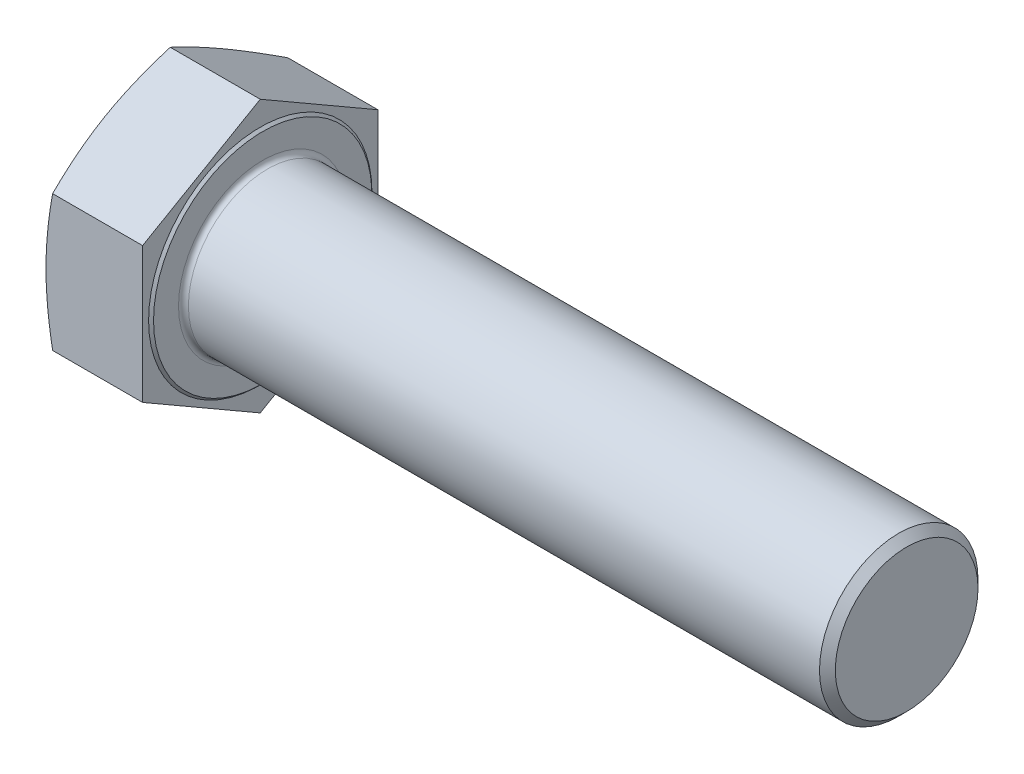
from build123d import *

# Parameters (mm, degrees)
BASEHEAD_DEPTH = 40
SKETCH5_R      = 32
BASEBODY_DEPTH = 260
CHAMFER1_SIZE  = 3.2
HEADFILLET_R   = 2


with BuildPart() as part:
    # Sketch2 → BaseHead (new body)
    with BuildSketch(Plane(origin=(0, 0, 0), x_dir=(0, 0, -1), z_dir=(1, 0, 0))):
        Polygon((0, -54.848275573), (47.5, -27.424137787), (47.5, 27.424137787), (0, 54.848275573), (-47.5, 27.424137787), (-47.5, -27.424137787), align=None)
    extrude(amount=BASEHEAD_DEPTH)

    # Sketch3 → BearingFace (revolve, cut)
    with BuildSketch(Plane.XY, mode=Mode.PRIVATE) as bearingface_sk:
        Polygon((40, 54.848275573), (40, 44.08), (39, 45.08), (39, 54.848275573), align=None)
    revolve(bearingface_sk.sketch.rotate(Axis((-0.957090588, 0, 0), (1, 0, 0)), 90), axis=Axis((-0.957090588, 0, 0), (1, 0, 0)), mode=Mode.SUBTRACT)

    # Sketch4 → HeadChamfer (revolve, cut)
    with BuildSketch(Plane.XY):
        Polygon((0, 54.848275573), (2.674553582, 54.848275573), (0, 47.5), align=None)
    revolve(axis=Axis((-0.493528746, 0, 0), (1, 0, 0)), mode=Mode.SUBTRACT)

    # Sketch5 → BaseBody (add)
    with BuildSketch(Plane(origin=(40, 0, 0), x_dir=(0, 0, -1), z_dir=(1, 0, 0))):
        with Locations(Location((0, 0, 0), (0, 0, 180))):
            Circle(SKETCH5_R)
    extrude(amount=BASEBODY_DEPTH)

    # Chamfer1
    chamfer1_edges = [part.edges().sort_by_distance(p)[0] for p in [
        (300, 0, -32),
    ]]
    chamfer(chamfer1_edges, length=CHAMFER1_SIZE)

    # HeadFillet
    headfillet_edges = [part.edges().sort_by_distance(p)[0] for p in [
        (40, 0, -32),
    ]]
    fillet(headfillet_edges, radius=HEADFILLET_R)


solid = part.part
